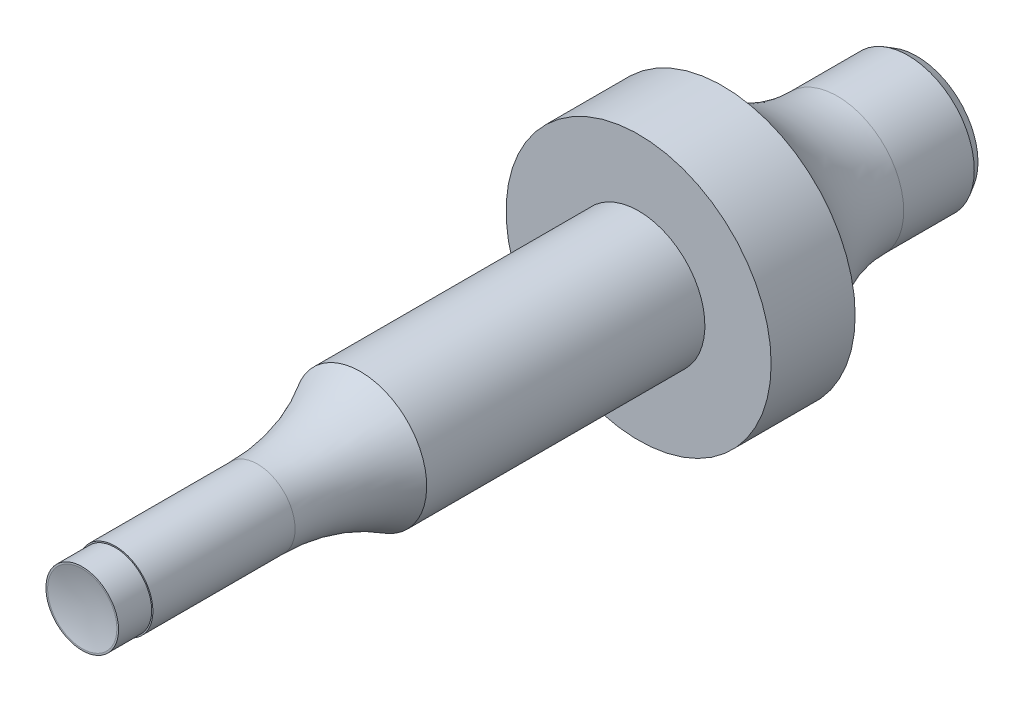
ISO-10303-21;
HEADER;
FILE_DESCRIPTION(('STEP AP214'),'2;1');
FILE_NAME('part.step','',(''),(''),'','','');
FILE_SCHEMA(('AUTOMOTIVE_DESIGN { 1 0 10303 214 1 1 1 1 }'));
ENDSEC;
DATA;
#1=APPLICATION_CONTEXT('core data for automotive mechanical design processes');
#2=APPLICATION_PROTOCOL_DEFINITION('international standard','automotive_design',2000,#1);
#3=PRODUCT_CONTEXT('',#1,'mechanical');
#4=PRODUCT('Part','Part','',(#3));
#5=PRODUCT_RELATED_PRODUCT_CATEGORY('part','',(#4));
#6=PRODUCT_DEFINITION_FORMATION('','',#4);
#7=PRODUCT_DEFINITION_CONTEXT('part definition',#1,'design');
#8=PRODUCT_DEFINITION('design','',#6,#7);
#9=PRODUCT_DEFINITION_SHAPE('','',#8);
#10=(LENGTH_UNIT() NAMED_UNIT(*) SI_UNIT(.MILLI.,.METRE.));
#11=(NAMED_UNIT(*) PLANE_ANGLE_UNIT() SI_UNIT($,.RADIAN.));
#12=(NAMED_UNIT(*) SI_UNIT($,.STERADIAN.) SOLID_ANGLE_UNIT());
#13=UNCERTAINTY_MEASURE_WITH_UNIT(LENGTH_MEASURE(1.E-05),#10,'distance_accuracy_value','');
#14=(GEOMETRIC_REPRESENTATION_CONTEXT(3) GLOBAL_UNCERTAINTY_ASSIGNED_CONTEXT((#13)) GLOBAL_UNIT_ASSIGNED_CONTEXT((#10,
#11,#12)) REPRESENTATION_CONTEXT('',''));
#15=CARTESIAN_POINT('',(0.,0.,0.));
#16=DIRECTION('',(0.,0.,1.));
#17=DIRECTION('',(1.,0.,0.));
#18=AXIS2_PLACEMENT_3D('',#15,#16,#17);
#19=CARTESIAN_POINT('',(0.,0.,-100.));
#20=DIRECTION('',(0.,0.,1.));
#21=DIRECTION('',(1.,0.,0.));
#22=AXIS2_PLACEMENT_3D('',#19,#20,#21);
#23=CYLINDRICAL_SURFACE('',#22,7.94);
#24=CARTESIAN_POINT('',(0.,0.,-33.3333333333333));
#25=DIRECTION('',(0.,0.,-1.));
#26=DIRECTION('',(0.,1.,0.));
#27=AXIS2_PLACEMENT_3D('',#24,#25,#26);
#28=CIRCLE('',#27,7.94);
#29=CARTESIAN_POINT('',(0.,7.94,-33.3333333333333));
#30=VERTEX_POINT('',#29);
#31=EDGE_CURVE('E77',#30,#30,#28,.T.);
#32=ORIENTED_EDGE('',*,*,#31,.T.);
#33=EDGE_LOOP('',(#32));
#34=FACE_BOUND('',#33,.T.);
#35=CARTESIAN_POINT('',(0.,0.,-66.6666666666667));
#36=DIRECTION('',(0.,0.,-1.));
#37=DIRECTION('',(-1.,0.,0.));
#38=AXIS2_PLACEMENT_3D('',#35,#36,#37);
#39=CIRCLE('',#38,7.94);
#40=CARTESIAN_POINT('',(-7.94,0.,-66.6666666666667));
#41=VERTEX_POINT('',#40);
#42=EDGE_CURVE('E44',#41,#41,#39,.F.);
#43=ORIENTED_EDGE('',*,*,#42,.T.);
#44=EDGE_LOOP('',(#43));
#45=FACE_BOUND('',#44,.T.);
#46=ADVANCED_FACE('F40',(#34,#45),#23,.T.);
#47=CARTESIAN_POINT('',(0.,0.,-33.3333333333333));
#48=DIRECTION('',(0.,0.,1.));
#49=DIRECTION('',(1.,0.,0.));
#50=AXIS2_PLACEMENT_3D('',#47,#48,#49);
#51=CYLINDRICAL_SURFACE('',#50,4.5);
#52=CARTESIAN_POINT('',(0.,0.,-21.002558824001));
#53=DIRECTION('',(0.,0.,1.));
#54=DIRECTION('',(0.,-1.,0.));
#55=AXIS2_PLACEMENT_3D('',#52,#53,#54);
#56=CIRCLE('',#55,4.5);
#57=CARTESIAN_POINT('',(0.,-4.5,-21.002558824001));
#58=VERTEX_POINT('',#57);
#59=EDGE_CURVE('E12',#58,#58,#56,.F.);
#60=ORIENTED_EDGE('',*,*,#59,.F.);
#61=EDGE_LOOP('',(#60));
#62=FACE_BOUND('',#61,.T.);
#63=CARTESIAN_POINT('',(0.,0.,-3.97));
#64=DIRECTION('',(0.,0.,1.));
#65=DIRECTION('',(1.,0.,0.));
#66=AXIS2_PLACEMENT_3D('',#63,#64,#65);
#67=CIRCLE('',#66,4.5);
#68=CARTESIAN_POINT('',(4.5,0.,-3.97));
#69=VERTEX_POINT('',#68);
#70=EDGE_CURVE('E61',#69,#69,#67,.F.);
#71=ORIENTED_EDGE('',*,*,#70,.T.);
#72=EDGE_LOOP('',(#71));
#73=FACE_BOUND('',#72,.T.);
#74=ADVANCED_FACE('F105',(#62,#73),#51,.T.);
#75=CARTESIAN_POINT('',(0.,0.,-3.97));
#76=DIRECTION('',(0.,0.,1.));
#77=DIRECTION('',(1.,0.,0.));
#78=AXIS2_PLACEMENT_3D('',#75,#76,#77);
#79=PLANE('',#78);
#80=ORIENTED_EDGE('',*,*,#70,.F.);
#81=EDGE_LOOP('',(#80));
#82=FACE_BOUND('',#81,.T.);
#83=CARTESIAN_POINT('',(0.,0.,-3.97));
#84=DIRECTION('',(0.,0.,1.));
#85=DIRECTION('',(1.,0.,0.));
#86=AXIS2_PLACEMENT_3D('',#83,#84,#85);
#87=CIRCLE('',#86,4.35);
#88=CARTESIAN_POINT('',(4.35,0.,-3.97));
#89=VERTEX_POINT('',#88);
#90=EDGE_CURVE('E65',#89,#89,#87,.T.);
#91=ORIENTED_EDGE('',*,*,#90,.F.);
#92=EDGE_LOOP('',(#91));
#93=FACE_BOUND('',#92,.T.);
#94=ADVANCED_FACE('F110',(#82,#93),#79,.T.);
#95=CARTESIAN_POINT('',(0.,0.,-3.97));
#96=DIRECTION('',(0.,0.,1.));
#97=DIRECTION('',(1.,0.,0.));
#98=AXIS2_PLACEMENT_3D('',#95,#96,#97);
#99=CYLINDRICAL_SURFACE('',#98,4.35);
#100=ORIENTED_EDGE('',*,*,#90,.T.);
#101=EDGE_LOOP('',(#100));
#102=FACE_BOUND('',#101,.T.);
#103=CARTESIAN_POINT('',(0.,0.,0.));
#104=DIRECTION('',(0.,0.,1.));
#105=DIRECTION('',(1.,0.,0.));
#106=AXIS2_PLACEMENT_3D('',#103,#104,#105);
#107=CIRCLE('',#106,4.35);
#108=CARTESIAN_POINT('',(4.35,0.,0.));
#109=VERTEX_POINT('',#108);
#110=EDGE_CURVE('E66',#109,#109,#107,.T.);
#111=ORIENTED_EDGE('',*,*,#110,.F.);
#112=EDGE_LOOP('',(#111));
#113=FACE_BOUND('',#112,.T.);
#114=ADVANCED_FACE('F147',(#102,#113),#99,.T.);
#115=CARTESIAN_POINT('',(0.,0.,0.));
#116=DIRECTION('',(0.,0.,1.));
#117=DIRECTION('',(1.,0.,0.));
#118=AXIS2_PLACEMENT_3D('',#115,#116,#117);
#119=PLANE('',#118);
#120=CARTESIAN_POINT('',(0.,0.,0.));
#121=DIRECTION('',(0.,0.,1.));
#122=DIRECTION('',(0.,-1.,0.));
#123=AXIS2_PLACEMENT_3D('',#120,#121,#122);
#124=CIRCLE('',#123,4.15);
#125=CARTESIAN_POINT('',(0.,-4.15,0.));
#126=VERTEX_POINT('',#125);
#127=EDGE_CURVE('E70',#126,#126,#124,.T.);
#128=ORIENTED_EDGE('',*,*,#127,.F.);
#129=EDGE_LOOP('',(#128));
#130=FACE_BOUND('',#129,.T.);
#131=ORIENTED_EDGE('',*,*,#110,.T.);
#132=EDGE_LOOP('',(#131));
#133=FACE_BOUND('',#132,.T.);
#134=ADVANCED_FACE('F145',(#130,#133),#119,.T.);
#135=CARTESIAN_POINT('',(0.,0.,15.3281407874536));
#136=DIRECTION('',(0.,0.,1.));
#137=DIRECTION('',(0.,1.,0.));
#138=AXIS2_PLACEMENT_3D('',#135,#136,#137);
#139=SPHERICAL_SURFACE('',#138,15.88);
#140=ORIENTED_EDGE('',*,*,#127,.T.);
#141=EDGE_LOOP('',(#140));
#142=FACE_BOUND('',#141,.T.);
#143=ADVANCED_FACE('F142',(#142),#139,.F.);
#144=CARTESIAN_POINT('',(0.,0.,-21.002558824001));
#145=DIRECTION('',(0.,0.,-1.));
#146=DIRECTION('',(0.,1.,0.));
#147=AXIS2_PLACEMENT_3D('',#144,#145,#146);
#148=TOROIDAL_SURFACE('',#147,28.32,23.82);
#149=ORIENTED_EDGE('',*,*,#59,.T.);
#150=EDGE_LOOP('',(#149));
#151=FACE_BOUND('',#150,.T.);
#152=ORIENTED_EDGE('',*,*,#31,.F.);
#153=EDGE_LOOP('',(#152));
#154=FACE_BOUND('',#153,.T.);
#155=ADVANCED_FACE('F123',(#151,#154),#148,.F.);
#156=CARTESIAN_POINT('',(0.,0.,-66.6666666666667));
#157=DIRECTION('',(0.,0.,-1.));
#158=DIRECTION('',(-1.,0.,0.));
#159=AXIS2_PLACEMENT_3D('',#156,#157,#158);
#160=PLANE('',#159);
#161=ORIENTED_EDGE('',*,*,#42,.F.);
#162=EDGE_LOOP('',(#161));
#163=FACE_BOUND('',#162,.T.);
#164=CARTESIAN_POINT('',(0.,0.,-66.6666666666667));
#165=DIRECTION('',(0.,0.,1.));
#166=DIRECTION('',(1.,0.,0.));
#167=AXIS2_PLACEMENT_3D('',#164,#165,#166);
#168=CIRCLE('',#167,15.88);
#169=CARTESIAN_POINT('',(15.88,0.,-66.6666666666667));
#170=VERTEX_POINT('',#169);
#171=EDGE_CURVE('E81',#170,#170,#168,.T.);
#172=ORIENTED_EDGE('',*,*,#171,.T.);
#173=EDGE_LOOP('',(#172));
#174=FACE_BOUND('',#173,.T.);
#175=ADVANCED_FACE('F119',(#163,#174),#160,.F.);
#176=CARTESIAN_POINT('',(0.,0.,-66.6666666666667));
#177=DIRECTION('',(0.,0.,1.));
#178=DIRECTION('',(1.,0.,0.));
#179=AXIS2_PLACEMENT_3D('',#176,#177,#178);
#180=CYLINDRICAL_SURFACE('',#179,15.88);
#181=ORIENTED_EDGE('',*,*,#171,.F.);
#182=EDGE_LOOP('',(#181));
#183=FACE_BOUND('',#182,.T.);
#184=CARTESIAN_POINT('',(0.,0.,-76.7341832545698));
#185=DIRECTION('',(0.,0.,1.));
#186=DIRECTION('',(1.,0.,0.));
#187=AXIS2_PLACEMENT_3D('',#184,#185,#186);
#188=CIRCLE('',#187,15.88);
#189=CARTESIAN_POINT('',(15.88,0.,-76.7341832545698));
#190=VERTEX_POINT('',#189);
#191=EDGE_CURVE('E85',#190,#190,#188,.T.);
#192=ORIENTED_EDGE('',*,*,#191,.T.);
#193=EDGE_LOOP('',(#192));
#194=FACE_BOUND('',#193,.T.);
#195=ADVANCED_FACE('F122',(#183,#194),#180,.T.);
#196=CARTESIAN_POINT('',(0.,0.,-90.4866666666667));
#197=DIRECTION('',(0.,0.,1.));
#198=DIRECTION('',(1.,0.,0.));
#199=AXIS2_PLACEMENT_3D('',#196,#197,#198);
#200=TOROIDAL_SURFACE('',#199,23.82,15.88);
#201=ORIENTED_EDGE('',*,*,#191,.F.);
#202=EDGE_LOOP('',(#201));
#203=FACE_BOUND('',#202,.T.);
#204=CARTESIAN_POINT('',(0.,0.,-90.4866666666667));
#205=DIRECTION('',(0.,0.,1.));
#206=DIRECTION('',(1.,0.,0.));
#207=AXIS2_PLACEMENT_3D('',#204,#205,#206);
#208=CIRCLE('',#207,7.94);
#209=CARTESIAN_POINT('',(7.94,0.,-90.4866666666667));
#210=VERTEX_POINT('',#209);
#211=EDGE_CURVE('E88',#210,#210,#208,.T.);
#212=ORIENTED_EDGE('',*,*,#211,.T.);
#213=EDGE_LOOP('',(#212));
#214=FACE_BOUND('',#213,.T.);
#215=ADVANCED_FACE('F93',(#203,#214),#200,.F.);
#216=CARTESIAN_POINT('',(0.,0.,-100.));
#217=DIRECTION('',(0.,0.,1.));
#218=DIRECTION('',(1.,0.,0.));
#219=AXIS2_PLACEMENT_3D('',#216,#217,#218);
#220=PLANE('',#219);
#221=CARTESIAN_POINT('',(0.,0.,-100.));
#222=DIRECTION('',(0.,0.,1.));
#223=DIRECTION('',(1.,0.,0.));
#224=AXIS2_PLACEMENT_3D('',#221,#222,#223);
#225=CIRCLE('',#224,7.3287785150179);
#226=CARTESIAN_POINT('',(7.3287785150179,0.,-100.));
#227=VERTEX_POINT('',#226);
#228=EDGE_CURVE('E49',#227,#227,#225,.F.);
#229=ORIENTED_EDGE('',*,*,#228,.T.);
#230=EDGE_LOOP('',(#229));
#231=FACE_BOUND('',#230,.T.);
#232=ADVANCED_FACE('F101',(#231),#220,.F.);
#233=CARTESIAN_POINT('',(0.,0.,-98.9413333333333));
#234=DIRECTION('',(0.,0.,1.));
#235=DIRECTION('',(1.,0.,0.));
#236=AXIS2_PLACEMENT_3D('',#233,#234,#235);
#237=CONICAL_SURFACE('',#236,7.94,0.523598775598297);
#238=ORIENTED_EDGE('',*,*,#228,.F.);
#239=EDGE_LOOP('',(#238));
#240=FACE_BOUND('',#239,.T.);
#241=CARTESIAN_POINT('',(0.,0.,-98.9413333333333));
#242=DIRECTION('',(0.,0.,1.));
#243=DIRECTION('',(1.,0.,0.));
#244=AXIS2_PLACEMENT_3D('',#241,#242,#243);
#245=CIRCLE('',#244,7.94);
#246=CARTESIAN_POINT('',(7.94,0.,-98.9413333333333));
#247=VERTEX_POINT('',#246);
#248=EDGE_CURVE('E55',#247,#247,#245,.T.);
#249=ORIENTED_EDGE('',*,*,#248,.F.);
#250=EDGE_LOOP('',(#249));
#251=FACE_BOUND('',#250,.T.);
#252=ADVANCED_FACE('F42',(#240,#251),#237,.T.);
#253=ORIENTED_EDGE('',*,*,#248,.T.);
#254=EDGE_LOOP('',(#253));
#255=FACE_BOUND('',#254,.T.);
#256=ORIENTED_EDGE('',*,*,#211,.F.);
#257=EDGE_LOOP('',(#256));
#258=FACE_BOUND('',#257,.T.);
#259=ADVANCED_FACE('F95',(#255,#258),#23,.T.);
#260=CLOSED_SHELL('',(#46,#74,#94,#114,#134,#143,#155,#175,#195,#215,#232,#252,#259));
#261=MANIFOLD_SOLID_BREP('B2',#260);
#262=ADVANCED_BREP_SHAPE_REPRESENTATION('',(#18,#261),#14);
#263=SHAPE_DEFINITION_REPRESENTATION(#9,#262);
ENDSEC;
END-ISO-10303-21;
